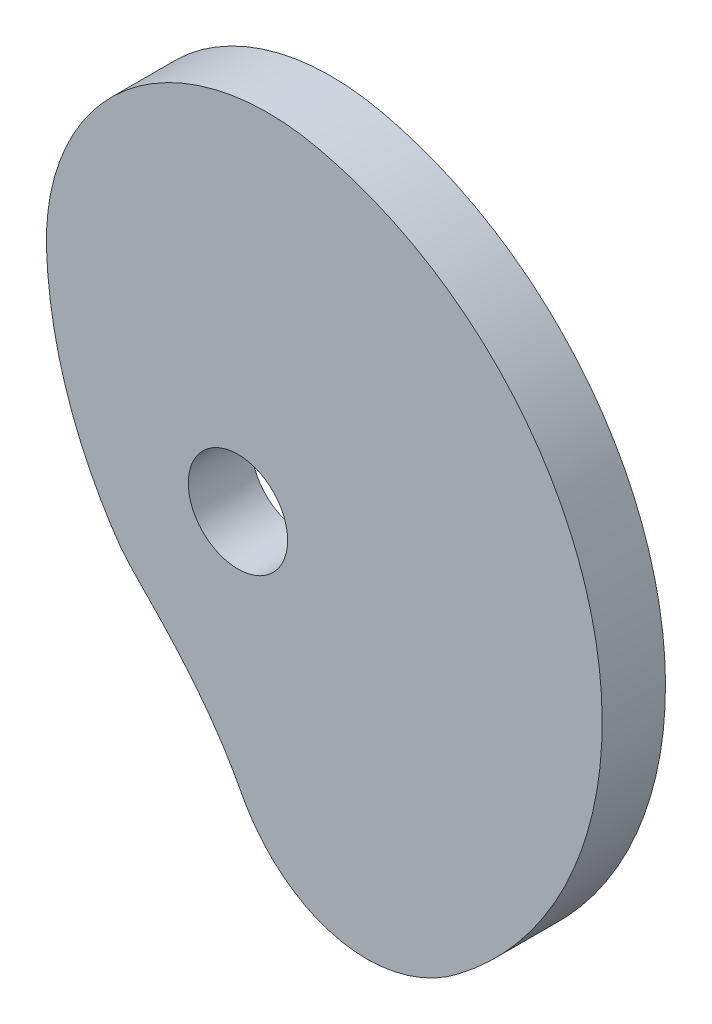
ISO-10303-21;
HEADER;
FILE_DESCRIPTION(('STEP AP214'),'2;1');
FILE_NAME('part.step','',(''),(''),'','','');
FILE_SCHEMA(('AUTOMOTIVE_DESIGN { 1 0 10303 214 1 1 1 1 }'));
ENDSEC;
DATA;
#1=APPLICATION_CONTEXT('core data for automotive mechanical design processes');
#2=APPLICATION_PROTOCOL_DEFINITION('international standard','automotive_design',2000,#1);
#3=PRODUCT_CONTEXT('',#1,'mechanical');
#4=PRODUCT('Part','Part','',(#3));
#5=PRODUCT_RELATED_PRODUCT_CATEGORY('part','',(#4));
#6=PRODUCT_DEFINITION_FORMATION('','',#4);
#7=PRODUCT_DEFINITION_CONTEXT('part definition',#1,'design');
#8=PRODUCT_DEFINITION('design','',#6,#7);
#9=PRODUCT_DEFINITION_SHAPE('','',#8);
#10=(LENGTH_UNIT() NAMED_UNIT(*) SI_UNIT(.MILLI.,.METRE.));
#11=(NAMED_UNIT(*) PLANE_ANGLE_UNIT() SI_UNIT($,.RADIAN.));
#12=(NAMED_UNIT(*) SI_UNIT($,.STERADIAN.) SOLID_ANGLE_UNIT());
#13=UNCERTAINTY_MEASURE_WITH_UNIT(LENGTH_MEASURE(1.E-05),#10,'distance_accuracy_value','');
#14=(GEOMETRIC_REPRESENTATION_CONTEXT(3) GLOBAL_UNCERTAINTY_ASSIGNED_CONTEXT((#13)) GLOBAL_UNIT_ASSIGNED_CONTEXT((#10,
#11,#12)) REPRESENTATION_CONTEXT('',''));
#15=CARTESIAN_POINT('',(0.,0.,0.));
#16=DIRECTION('',(0.,0.,1.));
#17=DIRECTION('',(1.,0.,0.));
#18=AXIS2_PLACEMENT_3D('',#15,#16,#17);
#19=CARTESIAN_POINT('',(-238.8,419.,20.));
#20=CARTESIAN_POINT('',(-240.785549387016,419.451418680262,20.));
#21=CARTESIAN_POINT('',(-244.788016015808,420.230024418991,20.));
#22=CARTESIAN_POINT('',(-250.904051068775,420.862434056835,20.));
#23=CARTESIAN_POINT('',(-257.105155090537,420.952859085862,20.));
#24=CARTESIAN_POINT('',(-263.367038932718,420.479855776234,20.));
#25=CARTESIAN_POINT('',(-269.630636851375,419.440830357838,20.));
#26=CARTESIAN_POINT('',(-275.844262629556,417.815469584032,20.));
#27=CARTESIAN_POINT('',(-281.946684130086,415.610873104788,20.));
#28=CARTESIAN_POINT('',(-287.863500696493,412.796936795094,20.));
#29=CARTESIAN_POINT('',(-293.554350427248,409.438902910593,20.));
#30=CARTESIAN_POINT('',(-298.936061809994,405.518031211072,20.));
#31=CARTESIAN_POINT('',(-303.938616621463,401.06736358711,20.));
#32=CARTESIAN_POINT('',(-308.529133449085,396.154387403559,20.));
#33=CARTESIAN_POINT('',(-312.62956348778,390.80306216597,20.));
#34=CARTESIAN_POINT('',(-316.191103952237,385.076733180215,20.));
#35=CARTESIAN_POINT('',(-319.181747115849,379.054734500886,20.));
#36=CARTESIAN_POINT('',(-321.576285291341,372.809708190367,20.));
#37=CARTESIAN_POINT('',(-323.343834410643,366.418198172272,20.));
#38=CARTESIAN_POINT('',(-324.496577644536,359.969739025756,20.));
#39=CARTESIAN_POINT('',(-325.027897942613,353.553579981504,20.));
#40=CARTESIAN_POINT('',(-324.957635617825,347.328457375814,20.));
#41=CARTESIAN_POINT('',(-324.529212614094,341.446138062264,20.));
#42=CARTESIAN_POINT('',(-323.925844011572,335.992210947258,20.));
#43=CARTESIAN_POINT('',(-323.14958990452,330.971109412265,20.));
#44=CARTESIAN_POINT('',(-322.258728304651,326.340072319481,20.));
#45=CARTESIAN_POINT('',(-321.27446550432,322.053252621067,20.));
#46=CARTESIAN_POINT('',(-320.223091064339,318.076540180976,20.));
#47=CARTESIAN_POINT('',(-319.11817414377,314.370470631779,20.));
#48=CARTESIAN_POINT('',(-317.974868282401,310.909086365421,20.));
#49=CARTESIAN_POINT('',(-316.815577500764,307.656303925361,20.));
#50=CARTESIAN_POINT('',(-315.619343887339,304.598738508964,20.));
#51=CARTESIAN_POINT('',(-314.408006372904,301.706467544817,20.));
#52=CARTESIAN_POINT('',(-313.184167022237,298.95587351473,20.));
#53=CARTESIAN_POINT('',(-311.947453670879,296.33827947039,20.));
#54=CARTESIAN_POINT('',(-310.686893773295,293.839645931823,20.));
#55=CARTESIAN_POINT('',(-309.434347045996,291.436563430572,20.));
#56=CARTESIAN_POINT('',(-308.143560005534,289.133716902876,20.));
#57=CARTESIAN_POINT('',(-306.857016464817,286.899348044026,20.));
#58=CARTESIAN_POINT('',(-305.544114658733,284.737071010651,20.));
#59=CARTESIAN_POINT('',(-304.212036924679,282.637955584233,20.));
#60=CARTESIAN_POINT('',(-302.865599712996,280.581033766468,20.));
#61=CARTESIAN_POINT('',(-301.438429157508,278.597123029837,20.));
#62=CARTESIAN_POINT('',(-299.906373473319,276.697942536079,20.));
#63=CARTESIAN_POINT('',(-298.281405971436,274.877471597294,20.));
#64=CARTESIAN_POINT('',(-296.531084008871,273.194798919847,20.));
#65=CARTESIAN_POINT('',(-294.89655886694,271.427316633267,20.));
#66=CARTESIAN_POINT('',(-293.215300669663,269.731237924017,20.));
#67=CARTESIAN_POINT('',(-291.555550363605,268.020820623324,20.));
#68=CARTESIAN_POINT('',(-289.905406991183,266.28768217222,20.));
#69=CARTESIAN_POINT('',(-288.246325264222,264.529906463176,20.));
#70=CARTESIAN_POINT('',(-286.576032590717,262.733078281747,20.));
#71=CARTESIAN_POINT('',(-284.894944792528,260.874571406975,20.));
#72=CARTESIAN_POINT('',(-283.172182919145,258.962383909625,20.));
#73=CARTESIAN_POINT('',(-281.431553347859,256.946179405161,20.));
#74=CARTESIAN_POINT('',(-279.646735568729,254.82041962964,20.));
#75=CARTESIAN_POINT('',(-277.808596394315,252.566363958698,20.));
#76=CARTESIAN_POINT('',(-275.921328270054,250.140165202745,20.));
#77=CARTESIAN_POINT('',(-273.951599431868,247.523300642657,20.));
#78=CARTESIAN_POINT('',(-271.900243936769,244.657694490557,20.));
#79=CARTESIAN_POINT('',(-269.7539475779,241.487743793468,20.));
#80=CARTESIAN_POINT('',(-267.507377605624,237.926935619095,20.));
#81=CARTESIAN_POINT('',(-265.136715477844,233.88792205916,20.));
#82=CARTESIAN_POINT('',(-262.830959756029,229.36964088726,20.));
#83=CARTESIAN_POINT('',(-260.052727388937,224.853650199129,20.));
#84=CARTESIAN_POINT('',(-256.80040528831,220.642491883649,20.));
#85=CARTESIAN_POINT('',(-253.149769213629,216.81453184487,20.));
#86=CARTESIAN_POINT('',(-249.127941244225,213.424536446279,20.));
#87=CARTESIAN_POINT('',(-244.757209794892,210.531332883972,20.));
#88=CARTESIAN_POINT('',(-240.075199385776,208.18974467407,20.));
#89=CARTESIAN_POINT('',(-235.131507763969,206.429148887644,20.));
#90=CARTESIAN_POINT('',(-229.966783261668,205.308276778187,20.));
#91=CARTESIAN_POINT('',(-224.648347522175,204.832245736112,20.));
#92=CARTESIAN_POINT('',(-219.233374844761,205.058260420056,20.));
#93=CARTESIAN_POINT('',(-213.798497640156,205.987125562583,20.));
#94=CARTESIAN_POINT('',(-208.407010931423,207.610488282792,20.));
#95=CARTESIAN_POINT('',(-203.132800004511,209.910987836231,20.));
#96=CARTESIAN_POINT('',(-198.034958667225,212.860445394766,20.));
#97=CARTESIAN_POINT('',(-193.279821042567,216.475851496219,20.));
#98=CARTESIAN_POINT('',(-188.632773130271,220.292766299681,20.));
#99=CARTESIAN_POINT('',(-184.216099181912,224.386696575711,20.));
#100=CARTESIAN_POINT('',(-179.999254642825,228.684058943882,20.));
#101=CARTESIAN_POINT('',(-176.020248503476,233.204082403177,20.));
#102=CARTESIAN_POINT('',(-172.288117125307,237.929546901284,20.));
#103=CARTESIAN_POINT('',(-168.804557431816,242.841534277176,20.));
#104=CARTESIAN_POINT('',(-165.588684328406,247.931543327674,20.));
#105=CARTESIAN_POINT('',(-162.629668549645,253.177384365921,20.));
#106=CARTESIAN_POINT('',(-159.964450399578,258.574357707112,20.));
#107=CARTESIAN_POINT('',(-157.58131310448,264.106288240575,20.));
#108=CARTESIAN_POINT('',(-155.479458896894,269.747439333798,20.));
#109=CARTESIAN_POINT('',(-153.688834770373,275.500528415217,20.));
#110=CARTESIAN_POINT('',(-152.198346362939,281.334808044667,20.));
#111=CARTESIAN_POINT('',(-151.022016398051,287.240919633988,20.));
#112=CARTESIAN_POINT('',(-150.134544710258,293.19703709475,20.));
#113=CARTESIAN_POINT('',(-149.577077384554,299.192786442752,20.));
#114=CARTESIAN_POINT('',(-149.338462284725,305.211177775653,20.));
#115=CARTESIAN_POINT('',(-149.409045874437,311.232379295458,20.));
#116=CARTESIAN_POINT('',(-149.785489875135,317.244506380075,20.));
#117=CARTESIAN_POINT('',(-150.488571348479,323.225604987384,20.));
#118=CARTESIAN_POINT('',(-151.498441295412,329.160525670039,20.));
#119=CARTESIAN_POINT('',(-152.818488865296,335.035864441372,20.));
#120=CARTESIAN_POINT('',(-154.451424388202,340.831527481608,20.));
#121=CARTESIAN_POINT('',(-156.369657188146,346.538312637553,20.));
#122=CARTESIAN_POINT('',(-158.589858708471,352.134517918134,20.));
#123=CARTESIAN_POINT('',(-161.11848792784,357.60121957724,20.));
#124=CARTESIAN_POINT('',(-163.897851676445,362.944339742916,20.));
#125=CARTESIAN_POINT('',(-166.978148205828,368.119838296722,20.));
#126=CARTESIAN_POINT('',(-170.317430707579,373.128658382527,20.));
#127=CARTESIAN_POINT('',(-173.910337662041,377.96303844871,20.));
#128=CARTESIAN_POINT('',(-177.745907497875,382.60523143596,20.));
#129=CARTESIAN_POINT('',(-181.83585621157,387.024433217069,20.));
#130=CARTESIAN_POINT('',(-186.134279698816,391.240610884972,20.));
#131=CARTESIAN_POINT('',(-190.654040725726,395.219756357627,20.));
#132=CARTESIAN_POINT('',(-195.379493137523,398.951997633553,20.));
#133=CARTESIAN_POINT('',(-200.291791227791,402.434978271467,20.));
#134=CARTESIAN_POINT('',(-205.383025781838,405.654611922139,20.));
#135=CARTESIAN_POINT('',(-210.633521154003,408.605150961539,20.));
#136=CARTESIAN_POINT('',(-216.030992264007,411.278399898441,20.));
#137=CARTESIAN_POINT('',(-221.557189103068,413.668077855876,20.));
#138=CARTESIAN_POINT('',(-227.204666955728,415.763052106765,20.));
#139=CARTESIAN_POINT('',(-232.956732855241,417.54392388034,20.));
#140=CARTESIAN_POINT('',(-236.842886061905,418.555046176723,20.));
#141=CARTESIAN_POINT('',(-238.8,419.,20.));
#142=B_SPLINE_CURVE_WITH_KNOTS('',3,(#19,#20,#21,#22,#23,#24,#25,#26,#27,#28,#29,#30,#31,#32,
#33,#34,#35,#36,#37,#38,#39,#40,#41,#42,#43,#44,#45,#46,#47,#48,#49,#50,#51,#52,#53,#54,#55,#56,
#57,#58,#59,#60,#61,#62,#63,#64,#65,#66,#67,#68,#69,#70,#71,#72,#73,#74,#75,#76,#77,#78,#79,#80,
#81,#82,#83,#84,#85,#86,#87,#88,#89,#90,#91,#92,#93,#94,#95,#96,#97,#98,#99,#100,#101,#102,#103,
#104,#105,#106,#107,#108,#109,#110,#111,#112,#113,#114,#115,#116,#117,#118,#119,#120,#121,#122,
#123,#124,#125,#126,#127,#128,#129,#130,#131,#132,#133,#134,#135,#136,#137,#138,#139,#140,#141),
.UNSPECIFIED.,.T.,.F.,(4,1,1,1,1,1,1,1,1,1,1,1,1,1,1,1,1,1,1,1,1,1,1,1,1,1,1,1,1,1,1,1,1,1,1,1,
1,1,1,1,1,1,1,1,1,1,1,1,1,1,1,1,1,1,1,1,1,1,1,1,1,1,1,1,1,1,1,1,1,1,1,1,1,1,1,1,1,1,1,1,1,1,1,1,
1,1,1,1,1,1,1,1,1,1,1,1,1,1,1,1,1,1,1,1,1,1,1,1,1,1,1,1,1,1,1,1,1,1,1,1,4),(0.,
0.0100683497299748,0.02014529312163,0.030367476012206,0.0407001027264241,0.0511615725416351,
0.0617258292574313,0.0724217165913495,0.0832028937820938,0.0940824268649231,0.105056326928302,
0.116079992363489,0.127149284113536,0.138261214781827,0.149368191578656,0.160449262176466,
0.171465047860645,0.182396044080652,0.193196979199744,0.203816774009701,0.214186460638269,
0.223952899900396,0.232977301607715,0.241317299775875,0.249073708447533,0.256296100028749,
0.263065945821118,0.269413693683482,0.275419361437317,0.281092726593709,0.286490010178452,
0.291655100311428,0.296599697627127,0.301378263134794,0.305971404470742,0.310440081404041,
0.314779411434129,0.319026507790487,0.32319111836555,0.327289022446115,0.331321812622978,
0.335348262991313,0.33936985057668,0.343385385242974,0.34740710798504,0.351371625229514,
0.355288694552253,0.35921757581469,0.363158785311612,0.367123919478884,0.371171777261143,
0.375291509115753,0.379517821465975,0.38390055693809,0.388464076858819,0.393245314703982,
0.398284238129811,0.403665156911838,0.409443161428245,0.415711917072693,0.422595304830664,
0.430263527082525,0.438864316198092,0.447675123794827,0.45644304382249,0.465129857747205,
0.473788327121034,0.482402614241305,0.490991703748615,0.499615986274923,0.508288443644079,
0.517060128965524,0.525953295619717,0.535016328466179,0.544258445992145,0.553731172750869,
0.563415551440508,0.573307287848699,0.583236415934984,0.593152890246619,0.603073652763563,
0.613002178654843,0.622919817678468,0.632841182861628,0.642770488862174,0.652683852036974,
0.662614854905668,0.672524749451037,0.682461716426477,0.692373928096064,0.702309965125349,
0.712229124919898,0.72214479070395,0.732079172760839,0.741994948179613,0.751919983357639,
0.761847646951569,0.771773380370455,0.781690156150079,0.791608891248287,0.801540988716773,
0.811456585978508,0.821372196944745,0.831300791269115,0.84123327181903,0.851145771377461,
0.861072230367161,0.870993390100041,0.880922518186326,0.890838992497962,0.900759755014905,
0.910688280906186,0.92060591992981,0.93052728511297,0.940456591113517,0.95038432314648,
0.960300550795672,0.97023211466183,0.980147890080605,0.990075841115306,1.),.UNSPECIFIED.);
#143=DIRECTION('',(0.,0.,-1.));
#144=VECTOR('',#143,1.);
#145=SURFACE_OF_LINEAR_EXTRUSION('',#142,#144);
#146=CARTESIAN_POINT('',(-238.8,419.,20.));
#147=VERTEX_POINT('',#146);
#148=EDGE_CURVE('E10',#147,#147,#142,.T.);
#149=ORIENTED_EDGE('',*,*,#148,.F.);
#150=EDGE_LOOP('',(#149));
#151=FACE_BOUND('',#150,.T.);
#152=CARTESIAN_POINT('',(-238.8,419.,0.));
#153=CARTESIAN_POINT('',(-240.785549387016,419.451418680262,0.));
#154=CARTESIAN_POINT('',(-244.788016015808,420.230024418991,0.));
#155=CARTESIAN_POINT('',(-250.904051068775,420.862434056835,0.));
#156=CARTESIAN_POINT('',(-257.105155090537,420.952859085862,0.));
#157=CARTESIAN_POINT('',(-263.367038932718,420.479855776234,0.));
#158=CARTESIAN_POINT('',(-269.630636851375,419.440830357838,0.));
#159=CARTESIAN_POINT('',(-275.844262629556,417.815469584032,0.));
#160=CARTESIAN_POINT('',(-281.946684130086,415.610873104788,0.));
#161=CARTESIAN_POINT('',(-287.863500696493,412.796936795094,0.));
#162=CARTESIAN_POINT('',(-293.554350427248,409.438902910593,0.));
#163=CARTESIAN_POINT('',(-298.936061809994,405.518031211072,0.));
#164=CARTESIAN_POINT('',(-303.938616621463,401.06736358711,0.));
#165=CARTESIAN_POINT('',(-308.529133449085,396.154387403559,0.));
#166=CARTESIAN_POINT('',(-312.62956348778,390.80306216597,0.));
#167=CARTESIAN_POINT('',(-316.191103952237,385.076733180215,0.));
#168=CARTESIAN_POINT('',(-319.181747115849,379.054734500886,0.));
#169=CARTESIAN_POINT('',(-321.576285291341,372.809708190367,0.));
#170=CARTESIAN_POINT('',(-323.343834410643,366.418198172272,0.));
#171=CARTESIAN_POINT('',(-324.496577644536,359.969739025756,0.));
#172=CARTESIAN_POINT('',(-325.027897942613,353.553579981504,0.));
#173=CARTESIAN_POINT('',(-324.957635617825,347.328457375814,0.));
#174=CARTESIAN_POINT('',(-324.529212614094,341.446138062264,0.));
#175=CARTESIAN_POINT('',(-323.925844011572,335.992210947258,0.));
#176=CARTESIAN_POINT('',(-323.14958990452,330.971109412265,0.));
#177=CARTESIAN_POINT('',(-322.258728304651,326.340072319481,0.));
#178=CARTESIAN_POINT('',(-321.27446550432,322.053252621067,0.));
#179=CARTESIAN_POINT('',(-320.223091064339,318.076540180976,0.));
#180=CARTESIAN_POINT('',(-319.11817414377,314.370470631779,0.));
#181=CARTESIAN_POINT('',(-317.974868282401,310.909086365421,0.));
#182=CARTESIAN_POINT('',(-316.815577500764,307.656303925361,0.));
#183=CARTESIAN_POINT('',(-315.619343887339,304.598738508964,0.));
#184=CARTESIAN_POINT('',(-314.408006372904,301.706467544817,0.));
#185=CARTESIAN_POINT('',(-313.184167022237,298.95587351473,0.));
#186=CARTESIAN_POINT('',(-311.947453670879,296.33827947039,0.));
#187=CARTESIAN_POINT('',(-310.686893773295,293.839645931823,0.));
#188=CARTESIAN_POINT('',(-309.434347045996,291.436563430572,0.));
#189=CARTESIAN_POINT('',(-308.143560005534,289.133716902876,0.));
#190=CARTESIAN_POINT('',(-306.857016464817,286.899348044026,0.));
#191=CARTESIAN_POINT('',(-305.544114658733,284.737071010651,0.));
#192=CARTESIAN_POINT('',(-304.212036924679,282.637955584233,0.));
#193=CARTESIAN_POINT('',(-302.865599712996,280.581033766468,0.));
#194=CARTESIAN_POINT('',(-301.438429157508,278.597123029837,0.));
#195=CARTESIAN_POINT('',(-299.906373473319,276.697942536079,0.));
#196=CARTESIAN_POINT('',(-298.281405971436,274.877471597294,0.));
#197=CARTESIAN_POINT('',(-296.531084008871,273.194798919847,0.));
#198=CARTESIAN_POINT('',(-294.89655886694,271.427316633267,0.));
#199=CARTESIAN_POINT('',(-293.215300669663,269.731237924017,0.));
#200=CARTESIAN_POINT('',(-291.555550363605,268.020820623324,0.));
#201=CARTESIAN_POINT('',(-289.905406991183,266.28768217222,0.));
#202=CARTESIAN_POINT('',(-288.246325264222,264.529906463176,0.));
#203=CARTESIAN_POINT('',(-286.576032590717,262.733078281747,0.));
#204=CARTESIAN_POINT('',(-284.894944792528,260.874571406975,0.));
#205=CARTESIAN_POINT('',(-283.172182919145,258.962383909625,0.));
#206=CARTESIAN_POINT('',(-281.431553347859,256.946179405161,0.));
#207=CARTESIAN_POINT('',(-279.646735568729,254.82041962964,0.));
#208=CARTESIAN_POINT('',(-277.808596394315,252.566363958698,0.));
#209=CARTESIAN_POINT('',(-275.921328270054,250.140165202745,0.));
#210=CARTESIAN_POINT('',(-273.951599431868,247.523300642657,0.));
#211=CARTESIAN_POINT('',(-271.900243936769,244.657694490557,0.));
#212=CARTESIAN_POINT('',(-269.7539475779,241.487743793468,0.));
#213=CARTESIAN_POINT('',(-267.507377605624,237.926935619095,0.));
#214=CARTESIAN_POINT('',(-265.136715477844,233.88792205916,0.));
#215=CARTESIAN_POINT('',(-262.830959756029,229.36964088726,0.));
#216=CARTESIAN_POINT('',(-260.052727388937,224.853650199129,0.));
#217=CARTESIAN_POINT('',(-256.80040528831,220.642491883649,0.));
#218=CARTESIAN_POINT('',(-253.149769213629,216.81453184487,0.));
#219=CARTESIAN_POINT('',(-249.127941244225,213.424536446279,0.));
#220=CARTESIAN_POINT('',(-244.757209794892,210.531332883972,0.));
#221=CARTESIAN_POINT('',(-240.075199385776,208.18974467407,0.));
#222=CARTESIAN_POINT('',(-235.131507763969,206.429148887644,0.));
#223=CARTESIAN_POINT('',(-229.966783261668,205.308276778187,0.));
#224=CARTESIAN_POINT('',(-224.648347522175,204.832245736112,0.));
#225=CARTESIAN_POINT('',(-219.233374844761,205.058260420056,0.));
#226=CARTESIAN_POINT('',(-213.798497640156,205.987125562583,0.));
#227=CARTESIAN_POINT('',(-208.407010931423,207.610488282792,0.));
#228=CARTESIAN_POINT('',(-203.132800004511,209.910987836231,0.));
#229=CARTESIAN_POINT('',(-198.034958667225,212.860445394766,0.));
#230=CARTESIAN_POINT('',(-193.279821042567,216.475851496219,0.));
#231=CARTESIAN_POINT('',(-188.632773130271,220.292766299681,0.));
#232=CARTESIAN_POINT('',(-184.216099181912,224.386696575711,0.));
#233=CARTESIAN_POINT('',(-179.999254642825,228.684058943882,0.));
#234=CARTESIAN_POINT('',(-176.020248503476,233.204082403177,0.));
#235=CARTESIAN_POINT('',(-172.288117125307,237.929546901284,0.));
#236=CARTESIAN_POINT('',(-168.804557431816,242.841534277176,0.));
#237=CARTESIAN_POINT('',(-165.588684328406,247.931543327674,0.));
#238=CARTESIAN_POINT('',(-162.629668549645,253.177384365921,0.));
#239=CARTESIAN_POINT('',(-159.964450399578,258.574357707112,0.));
#240=CARTESIAN_POINT('',(-157.58131310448,264.106288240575,0.));
#241=CARTESIAN_POINT('',(-155.479458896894,269.747439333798,0.));
#242=CARTESIAN_POINT('',(-153.688834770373,275.500528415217,0.));
#243=CARTESIAN_POINT('',(-152.198346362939,281.334808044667,0.));
#244=CARTESIAN_POINT('',(-151.022016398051,287.240919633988,0.));
#245=CARTESIAN_POINT('',(-150.134544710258,293.19703709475,0.));
#246=CARTESIAN_POINT('',(-149.577077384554,299.192786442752,0.));
#247=CARTESIAN_POINT('',(-149.338462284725,305.211177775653,0.));
#248=CARTESIAN_POINT('',(-149.409045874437,311.232379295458,0.));
#249=CARTESIAN_POINT('',(-149.785489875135,317.244506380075,0.));
#250=CARTESIAN_POINT('',(-150.488571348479,323.225604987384,0.));
#251=CARTESIAN_POINT('',(-151.498441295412,329.160525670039,0.));
#252=CARTESIAN_POINT('',(-152.818488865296,335.035864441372,0.));
#253=CARTESIAN_POINT('',(-154.451424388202,340.831527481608,0.));
#254=CARTESIAN_POINT('',(-156.369657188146,346.538312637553,0.));
#255=CARTESIAN_POINT('',(-158.589858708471,352.134517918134,0.));
#256=CARTESIAN_POINT('',(-161.11848792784,357.60121957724,0.));
#257=CARTESIAN_POINT('',(-163.897851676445,362.944339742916,0.));
#258=CARTESIAN_POINT('',(-166.978148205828,368.119838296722,0.));
#259=CARTESIAN_POINT('',(-170.317430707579,373.128658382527,0.));
#260=CARTESIAN_POINT('',(-173.910337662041,377.96303844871,0.));
#261=CARTESIAN_POINT('',(-177.745907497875,382.60523143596,0.));
#262=CARTESIAN_POINT('',(-181.83585621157,387.024433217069,0.));
#263=CARTESIAN_POINT('',(-186.134279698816,391.240610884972,0.));
#264=CARTESIAN_POINT('',(-190.654040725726,395.219756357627,0.));
#265=CARTESIAN_POINT('',(-195.379493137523,398.951997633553,0.));
#266=CARTESIAN_POINT('',(-200.291791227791,402.434978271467,0.));
#267=CARTESIAN_POINT('',(-205.383025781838,405.654611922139,0.));
#268=CARTESIAN_POINT('',(-210.633521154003,408.605150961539,0.));
#269=CARTESIAN_POINT('',(-216.030992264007,411.278399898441,0.));
#270=CARTESIAN_POINT('',(-221.557189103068,413.668077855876,0.));
#271=CARTESIAN_POINT('',(-227.204666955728,415.763052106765,0.));
#272=CARTESIAN_POINT('',(-232.956732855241,417.54392388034,0.));
#273=CARTESIAN_POINT('',(-236.842886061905,418.555046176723,0.));
#274=CARTESIAN_POINT('',(-238.8,419.,0.));
#275=B_SPLINE_CURVE_WITH_KNOTS('',3,(#152,#153,#154,#155,#156,#157,#158,#159,#160,#161,#162,
#163,#164,#165,#166,#167,#168,#169,#170,#171,#172,#173,#174,#175,#176,#177,#178,#179,#180,#181,
#182,#183,#184,#185,#186,#187,#188,#189,#190,#191,#192,#193,#194,#195,#196,#197,#198,#199,#200,
#201,#202,#203,#204,#205,#206,#207,#208,#209,#210,#211,#212,#213,#214,#215,#216,#217,#218,#219,
#220,#221,#222,#223,#224,#225,#226,#227,#228,#229,#230,#231,#232,#233,#234,#235,#236,#237,#238,
#239,#240,#241,#242,#243,#244,#245,#246,#247,#248,#249,#250,#251,#252,#253,#254,#255,#256,#257,
#258,#259,#260,#261,#262,#263,#264,#265,#266,#267,#268,#269,#270,#271,#272,#273,#274),
.UNSPECIFIED.,.T.,.F.,(4,1,1,1,1,1,1,1,1,1,1,1,1,1,1,1,1,1,1,1,1,1,1,1,1,1,1,1,1,1,1,1,1,1,1,1,
1,1,1,1,1,1,1,1,1,1,1,1,1,1,1,1,1,1,1,1,1,1,1,1,1,1,1,1,1,1,1,1,1,1,1,1,1,1,1,1,1,1,1,1,1,1,1,1,
1,1,1,1,1,1,1,1,1,1,1,1,1,1,1,1,1,1,1,1,1,1,1,1,1,1,1,1,1,1,1,1,1,1,1,1,4),(0.,
0.0100683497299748,0.02014529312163,0.030367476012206,0.0407001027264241,0.0511615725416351,
0.0617258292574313,0.0724217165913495,0.0832028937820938,0.0940824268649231,0.105056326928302,
0.116079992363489,0.127149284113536,0.138261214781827,0.149368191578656,0.160449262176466,
0.171465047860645,0.182396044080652,0.193196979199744,0.203816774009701,0.214186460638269,
0.223952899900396,0.232977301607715,0.241317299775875,0.249073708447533,0.256296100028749,
0.263065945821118,0.269413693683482,0.275419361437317,0.281092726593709,0.286490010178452,
0.291655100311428,0.296599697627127,0.301378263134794,0.305971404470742,0.310440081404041,
0.314779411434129,0.319026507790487,0.32319111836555,0.327289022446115,0.331321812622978,
0.335348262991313,0.33936985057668,0.343385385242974,0.34740710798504,0.351371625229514,
0.355288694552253,0.35921757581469,0.363158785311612,0.367123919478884,0.371171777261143,
0.375291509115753,0.379517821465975,0.38390055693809,0.388464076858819,0.393245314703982,
0.398284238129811,0.403665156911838,0.409443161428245,0.415711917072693,0.422595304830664,
0.430263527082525,0.438864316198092,0.447675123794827,0.45644304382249,0.465129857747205,
0.473788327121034,0.482402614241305,0.490991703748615,0.499615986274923,0.508288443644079,
0.517060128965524,0.525953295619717,0.535016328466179,0.544258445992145,0.553731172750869,
0.563415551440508,0.573307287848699,0.583236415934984,0.593152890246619,0.603073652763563,
0.613002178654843,0.622919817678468,0.632841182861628,0.642770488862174,0.652683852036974,
0.662614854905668,0.672524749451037,0.682461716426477,0.692373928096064,0.702309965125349,
0.712229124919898,0.72214479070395,0.732079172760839,0.741994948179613,0.751919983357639,
0.761847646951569,0.771773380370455,0.781690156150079,0.791608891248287,0.801540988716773,
0.811456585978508,0.821372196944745,0.831300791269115,0.84123327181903,0.851145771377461,
0.861072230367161,0.870993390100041,0.880922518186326,0.890838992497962,0.900759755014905,
0.910688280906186,0.92060591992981,0.93052728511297,0.940456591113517,0.95038432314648,
0.960300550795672,0.97023211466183,0.980147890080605,0.990075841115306,1.),.UNSPECIFIED.);
#276=CARTESIAN_POINT('',(-238.8,419.,0.));
#277=VERTEX_POINT('',#276);
#278=EDGE_CURVE('E356',#277,#277,#275,.T.);
#279=ORIENTED_EDGE('',*,*,#278,.T.);
#280=EDGE_LOOP('',(#279));
#281=FACE_BOUND('',#280,.T.);
#282=ADVANCED_FACE('F347',(#151,#281),#145,.F.);
#283=CARTESIAN_POINT('',(-234.88569904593,206.476654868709,20.));
#284=DIRECTION('',(0.,0.,-1.));
#285=DIRECTION('',(-1.,0.,0.));
#286=AXIS2_PLACEMENT_3D('',#283,#284,#285);
#287=PLANE('',#286);
#288=CARTESIAN_POINT('',(-264.462780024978,306.99277038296,20.));
#289=DIRECTION('',(0.,0.,1.));
#290=DIRECTION('',(1.,0.,0.));
#291=AXIS2_PLACEMENT_3D('',#288,#289,#290);
#292=CIRCLE('',#291,15.6981310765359);
#293=CARTESIAN_POINT('',(-248.764648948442,306.99277038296,20.));
#294=VERTEX_POINT('',#293);
#295=EDGE_CURVE('E360',#294,#294,#292,.T.);
#296=ORIENTED_EDGE('',*,*,#295,.F.);
#297=EDGE_LOOP('',(#296));
#298=FACE_BOUND('',#297,.T.);
#299=ORIENTED_EDGE('',*,*,#148,.T.);
#300=EDGE_LOOP('',(#299));
#301=FACE_BOUND('',#300,.T.);
#302=ADVANCED_FACE('F384',(#298,#301),#287,.F.);
#303=CARTESIAN_POINT('',(-234.88569904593,206.476654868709,0.));
#304=DIRECTION('',(0.,0.,-1.));
#305=DIRECTION('',(-1.,0.,0.));
#306=AXIS2_PLACEMENT_3D('',#303,#304,#305);
#307=PLANE('',#306);
#308=CARTESIAN_POINT('',(-264.462780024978,306.99277038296,0.));
#309=DIRECTION('',(0.,0.,-1.));
#310=DIRECTION('',(-1.,0.,0.));
#311=AXIS2_PLACEMENT_3D('',#308,#309,#310);
#312=CIRCLE('',#311,15.6981310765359);
#313=CARTESIAN_POINT('',(-280.160911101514,306.99277038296,0.));
#314=VERTEX_POINT('',#313);
#315=EDGE_CURVE('E364',#314,#314,#312,.F.);
#316=ORIENTED_EDGE('',*,*,#315,.T.);
#317=EDGE_LOOP('',(#316));
#318=FACE_BOUND('',#317,.T.);
#319=ORIENTED_EDGE('',*,*,#278,.F.);
#320=EDGE_LOOP('',(#319));
#321=FACE_BOUND('',#320,.T.);
#322=ADVANCED_FACE('F375',(#318,#321),#307,.T.);
#323=CARTESIAN_POINT('',(-264.462780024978,306.99277038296,-0.001000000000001));
#324=DIRECTION('',(0.,0.,1.));
#325=DIRECTION('',(1.,0.,0.));
#326=AXIS2_PLACEMENT_3D('',#323,#324,#325);
#327=CYLINDRICAL_SURFACE('',#326,15.6981310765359);
#328=ORIENTED_EDGE('',*,*,#315,.F.);
#329=EDGE_LOOP('',(#328));
#330=FACE_BOUND('',#329,.T.);
#331=ORIENTED_EDGE('',*,*,#295,.T.);
#332=EDGE_LOOP('',(#331));
#333=FACE_BOUND('',#332,.T.);
#334=ADVANCED_FACE('F378',(#330,#333),#327,.F.);
#335=CLOSED_SHELL('',(#282,#302,#322,#334));
#336=MANIFOLD_SOLID_BREP('B2',#335);
#337=ADVANCED_BREP_SHAPE_REPRESENTATION('',(#18,#336),#14);
#338=SHAPE_DEFINITION_REPRESENTATION(#9,#337);
ENDSEC;
END-ISO-10303-21;
